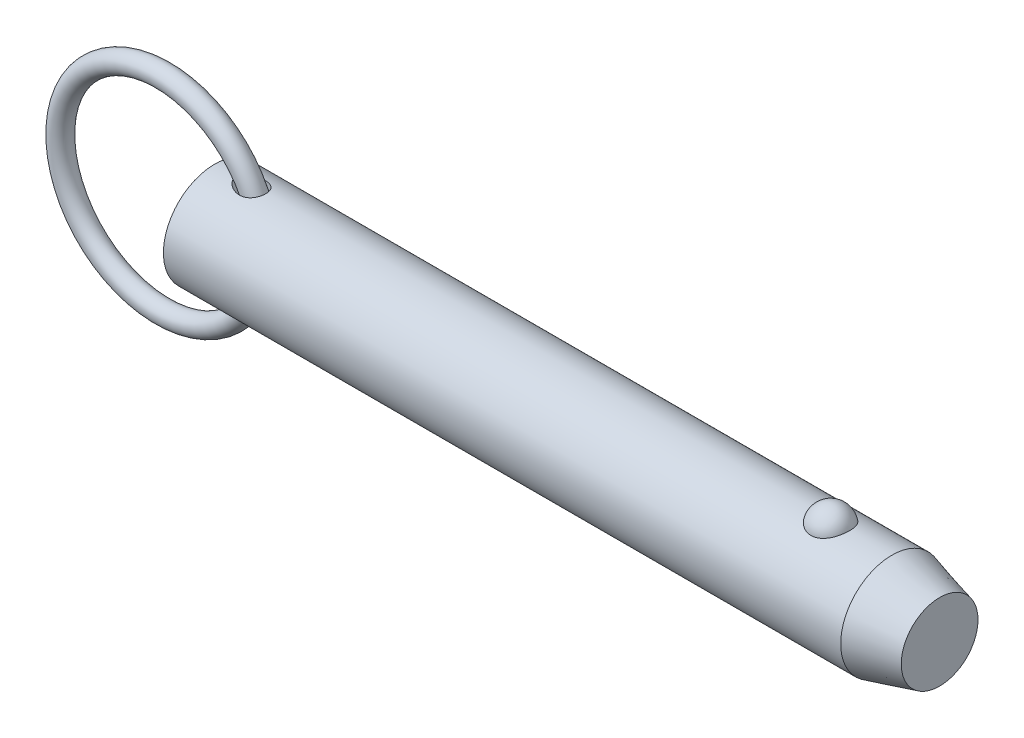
ISO-10303-21;
HEADER;
FILE_DESCRIPTION(('STEP AP214'),'2;1');
FILE_NAME('part.step','',(''),(''),'','','');
FILE_SCHEMA(('AUTOMOTIVE_DESIGN { 1 0 10303 214 1 1 1 1 }'));
ENDSEC;
DATA;
#1=APPLICATION_CONTEXT('core data for automotive mechanical design processes');
#2=APPLICATION_PROTOCOL_DEFINITION('international standard','automotive_design',2000,#1);
#3=PRODUCT_CONTEXT('',#1,'mechanical');
#4=PRODUCT('Part','Part','',(#3));
#5=PRODUCT_RELATED_PRODUCT_CATEGORY('part','',(#4));
#6=PRODUCT_DEFINITION_FORMATION('','',#4);
#7=PRODUCT_DEFINITION_CONTEXT('part definition',#1,'design');
#8=PRODUCT_DEFINITION('design','',#6,#7);
#9=PRODUCT_DEFINITION_SHAPE('','',#8);
#10=(LENGTH_UNIT() NAMED_UNIT(*) SI_UNIT(.MILLI.,.METRE.));
#11=(NAMED_UNIT(*) PLANE_ANGLE_UNIT() SI_UNIT($,.RADIAN.));
#12=(NAMED_UNIT(*) SI_UNIT($,.STERADIAN.) SOLID_ANGLE_UNIT());
#13=UNCERTAINTY_MEASURE_WITH_UNIT(LENGTH_MEASURE(1.E-05),#10,'distance_accuracy_value','');
#14=(GEOMETRIC_REPRESENTATION_CONTEXT(3) GLOBAL_UNCERTAINTY_ASSIGNED_CONTEXT((#13)) GLOBAL_UNIT_ASSIGNED_CONTEXT((#10,
#11,#12)) REPRESENTATION_CONTEXT('',''));
#15=CARTESIAN_POINT('',(0.,0.,0.));
#16=DIRECTION('',(0.,0.,1.));
#17=DIRECTION('',(1.,0.,0.));
#18=AXIS2_PLACEMENT_3D('',#15,#16,#17);
#19=CARTESIAN_POINT('',(-9.66825126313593,0.,0.));
#20=DIRECTION('',(0.,0.,1.));
#21=DIRECTION('',(1.,0.,0.));
#22=AXIS2_PLACEMENT_3D('',#19,#20,#21);
#23=TOROIDAL_SURFACE('',#22,19.05,1.905);
#24=CARTESIAN_POINT('',(11.2867487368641,0.,0.));
#25=VERTEX_POINT('',#24);
#26=VERTEX_LOOP('',#25);
#27=FACE_BOUND('',#26,.T.);
#28=ADVANCED_FACE('P0_F12',(#27),#23,.T.);
#29=CLOSED_SHELL('',(#28));
#30=MANIFOLD_SOLID_BREP('P0_B1',#29);
#31=CARTESIAN_POINT('',(0.,0.,0.));
#32=DIRECTION('',(1.,0.,0.));
#33=DIRECTION('',(0.,0.,-1.));
#34=AXIS2_PLACEMENT_3D('',#31,#32,#33);
#35=CYLINDRICAL_SURFACE('',#34,9.525);
#36=CARTESIAN_POINT('',(4.56693409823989,9.4314194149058,-1.33189820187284));
#37=CARTESIAN_POINT('',(4.70260475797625,9.41020313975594,-1.48215931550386));
#38=CARTESIAN_POINT('',(4.85555680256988,9.38755003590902,-1.61683982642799));
#39=CARTESIAN_POINT('',(5.10171959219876,9.35450554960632,-1.79512943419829));
#40=CARTESIAN_POINT('',(5.18674514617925,9.34362629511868,-1.85068909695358));
#41=CARTESIAN_POINT('',(5.3615438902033,9.32258514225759,-1.95392002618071));
#42=CARTESIAN_POINT('',(5.45131542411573,9.31242299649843,-2.00159402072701));
#43=CARTESIAN_POINT('',(5.70070211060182,9.28632120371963,-2.12033289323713));
#44=CARTESIAN_POINT('',(5.86420408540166,9.27146938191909,-2.18362944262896));
#45=CARTESIAN_POINT('',(6.19893345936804,9.24694163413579,-2.28525783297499));
#46=CARTESIAN_POINT('',(6.3701538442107,9.23726110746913,-2.32361187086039));
#47=CARTESIAN_POINT('',(6.73531776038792,9.22400982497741,-2.37575048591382));
#48=CARTESIAN_POINT('',(6.92975826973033,9.22118808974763,-2.38652934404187));
#49=CARTESIAN_POINT('',(7.21995443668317,9.22416297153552,-2.37494980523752));
#50=CARTESIAN_POINT('',(7.31643847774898,9.22635560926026,-2.366466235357));
#51=CARTESIAN_POINT('',(7.50796421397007,9.2331428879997,-2.33985028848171));
#52=CARTESIAN_POINT('',(7.60300650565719,9.23773650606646,-2.32172202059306));
#53=CARTESIAN_POINT('',(7.83273114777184,9.25183311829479,-2.26504721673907));
#54=CARTESIAN_POINT('',(7.96603028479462,9.26261470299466,-2.2209856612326));
#55=CARTESIAN_POINT('',(8.22310899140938,9.28816519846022,-2.1115730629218));
#56=CARTESIAN_POINT('',(8.34689477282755,9.30293147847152,-2.04623606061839));
#57=CARTESIAN_POINT('',(8.58136049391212,9.3349416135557,-1.89485344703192));
#58=CARTESIAN_POINT('',(8.69199721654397,9.35219324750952,-1.8087422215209));
#59=CARTESIAN_POINT('',(8.89592093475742,9.38707016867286,-1.6179918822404));
#60=CARTESIAN_POINT('',(8.98920771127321,9.40469546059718,-1.51335253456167));
#61=CARTESIAN_POINT('',(9.15057731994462,9.43713590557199,-1.29519427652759));
#62=CARTESIAN_POINT('',(9.21980158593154,9.45205440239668,-1.18253282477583));
#63=CARTESIAN_POINT('',(9.33826736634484,9.47856708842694,-0.946802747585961));
#64=CARTESIAN_POINT('',(9.38751161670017,9.49016173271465,-0.823735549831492));
#65=CARTESIAN_POINT('',(9.46423850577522,9.50859378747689,-0.572614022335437));
#66=CARTESIAN_POINT('',(9.4920239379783,9.5154972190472,-0.444656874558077));
#67=CARTESIAN_POINT('',(9.52636926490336,9.5240690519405,-0.185752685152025));
#68=CARTESIAN_POINT('',(9.53292923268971,9.52573747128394,-0.054805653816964));
#69=CARTESIAN_POINT('',(9.52467276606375,9.52365852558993,0.206503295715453));
#70=CARTESIAN_POINT('',(9.50983454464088,9.51990564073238,0.336864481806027));
#71=CARTESIAN_POINT('',(9.45907362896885,9.50737852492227,0.593166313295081));
#72=CARTESIAN_POINT('',(9.42315106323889,9.49860432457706,0.719106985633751));
#73=CARTESIAN_POINT('',(9.3310664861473,9.4769892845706,0.962959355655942));
#74=CARTESIAN_POINT('',(9.27490839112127,9.46414923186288,1.08087260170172));
#75=CARTESIAN_POINT('',(9.14375803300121,9.43581000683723,1.30534632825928));
#76=CARTESIAN_POINT('',(9.06876720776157,9.42031103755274,1.41190767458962));
#77=CARTESIAN_POINT('',(8.90203187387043,9.38836719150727,1.61069439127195));
#78=CARTESIAN_POINT('',(8.81029913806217,9.371922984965,1.70292975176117));
#79=CARTESIAN_POINT('',(8.6126877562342,9.33985045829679,1.87086859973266));
#80=CARTESIAN_POINT('',(8.50680947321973,9.3242221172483,1.94657251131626));
#81=CARTESIAN_POINT('',(8.28220546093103,9.29513431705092,2.08109032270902));
#82=CARTESIAN_POINT('',(8.16329919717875,9.28171415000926,2.13961034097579));
#83=CARTESIAN_POINT('',(7.91756052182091,9.25859072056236,2.23755716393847));
#84=CARTESIAN_POINT('',(7.79072606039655,9.24888842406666,2.27697900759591));
#85=CARTESIAN_POINT('',(7.52377913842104,9.23338749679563,2.33907806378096));
#86=CARTESIAN_POINT('',(7.3833476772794,9.22789571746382,2.36044900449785));
#87=CARTESIAN_POINT('',(7.1008139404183,9.22210229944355,2.3829751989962));
#88=CARTESIAN_POINT('',(6.95871103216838,9.22180269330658,2.38412253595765));
#89=CARTESIAN_POINT('',(6.65642691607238,9.22632724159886,2.36656230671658));
#90=CARTESIAN_POINT('',(6.49641694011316,9.23185415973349,2.3451317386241));
#91=CARTESIAN_POINT('',(6.18115433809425,9.24811737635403,2.28014143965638));
#92=CARTESIAN_POINT('',(6.02590710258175,9.25885936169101,2.23655754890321));
#93=CARTESIAN_POINT('',(5.69904720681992,9.28624254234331,2.12025087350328));
#94=CARTESIAN_POINT('',(5.52873601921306,9.30354853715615,2.04400672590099));
#95=CARTESIAN_POINT('',(5.20289495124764,9.34106989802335,1.86504730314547));
#96=CARTESIAN_POINT('',(5.0473596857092,9.36128419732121,1.76234172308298));
#97=CARTESIAN_POINT('',(4.7928712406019,9.39697639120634,1.55895334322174));
#98=CARTESIAN_POINT('',(4.68938704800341,9.41240250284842,1.46392900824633));
#99=CARTESIAN_POINT('',(4.4984714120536,9.44202586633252,1.25875918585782));
#100=CARTESIAN_POINT('',(4.41101129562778,9.45622528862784,1.1486413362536));
#101=CARTESIAN_POINT('',(4.27502257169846,9.47888210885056,0.94060098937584));
#102=CARTESIAN_POINT('',(4.22216329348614,9.48791121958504,0.845586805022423));
#103=CARTESIAN_POINT('',(4.13241478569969,9.50344321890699,0.648051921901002));
#104=CARTESIAN_POINT('',(4.0955118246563,9.50994827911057,0.545537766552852));
#105=CARTESIAN_POINT('',(4.04043124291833,9.51971586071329,0.334452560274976));
#106=CARTESIAN_POINT('',(4.02240728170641,9.52295176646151,0.225839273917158));
#107=CARTESIAN_POINT('',(4.00750873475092,9.52562364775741,0.00713006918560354));
#108=CARTESIAN_POINT('',(4.01062334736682,9.52506156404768,-0.102965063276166));
#109=CARTESIAN_POINT('',(4.03592967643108,9.52053221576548,-0.306944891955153));
#110=CARTESIAN_POINT('',(4.05571676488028,9.51699426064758,-0.401151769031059));
#111=CARTESIAN_POINT('',(4.10967975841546,9.5074546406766,-0.585176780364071));
#112=CARTESIAN_POINT('',(4.1438599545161,9.50145224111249,-0.674993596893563));
#113=CARTESIAN_POINT('',(4.23261356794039,9.48611703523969,-0.866116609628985));
#114=CARTESIAN_POINT('',(4.28990016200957,9.47635800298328,-0.966121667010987));
#115=CARTESIAN_POINT('',(4.4185657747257,9.45502867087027,-1.15640011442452));
#116=CARTESIAN_POINT('',(4.4899691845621,9.44345524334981,-1.24665623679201));
#117=CARTESIAN_POINT('',(4.56693409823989,9.4314194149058,-1.33189820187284));
#118=B_SPLINE_CURVE_WITH_KNOTS('',3,(#36,#37,#38,#39,#40,#41,#42,#43,#44,#45,#46,#47,#48,#49,
#50,#51,#52,#53,#54,#55,#56,#57,#58,#59,#60,#61,#62,#63,#64,#65,#66,#67,#68,#69,#70,#71,#72,#73,
#74,#75,#76,#77,#78,#79,#80,#81,#82,#83,#84,#85,#86,#87,#88,#89,#90,#91,#92,#93,#94,#95,#96,#97,
#98,#99,#100,#101,#102,#103,#104,#105,#106,#107,#108,#109,#110,#111,#112,#113,#114,#115,#116,
#117),.UNSPECIFIED.,.T.,.F.,(4,2,2,2,2,2,2,2,2,2,2,2,2,2,2,2,2,2,2,2,2,2,2,2,2,2,2,2,2,2,2,2,2,
2,2,2,2,2,2,2,4),(0.,0.609951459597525,0.916123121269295,1.22218863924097,1.74791337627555,
2.27316961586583,2.85362722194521,3.14383229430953,3.43391382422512,3.85437497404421,
4.27455920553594,4.69608835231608,5.11762282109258,5.51490051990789,5.91212379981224,
6.30363414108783,6.69514313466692,7.0870510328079,7.47895654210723,7.87078624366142,
8.26258603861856,8.65411137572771,9.0456266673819,9.44349251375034,9.84146165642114,
10.2662286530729,10.6911619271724,11.1739180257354,11.6572017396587,12.2170157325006,
12.776624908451,13.1992556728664,13.6211226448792,13.9471990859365,14.2729943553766,
14.6014211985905,14.9296802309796,15.2173810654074,15.505167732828,15.8505863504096,
16.1966070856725),.UNSPECIFIED.);
#119=CARTESIAN_POINT('',(4.56693409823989,9.4314194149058,-1.33189820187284));
#120=VERTEX_POINT('',#119);
#121=EDGE_CURVE('P1_E40',#120,#120,#118,.T.);
#122=ORIENTED_EDGE('',*,*,#121,.T.);
#123=EDGE_LOOP('',(#122));
#124=FACE_BOUND('',#123,.T.);
#125=CARTESIAN_POINT('',(126.043054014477,0.,0.));
#126=DIRECTION('',(1.,0.,0.));
#127=DIRECTION('',(0.,0.,-1.));
#128=AXIS2_PLACEMENT_3D('',#125,#126,#127);
#129=CIRCLE('',#128,9.525);
#130=CARTESIAN_POINT('',(126.043054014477,0.,-9.525));
#131=VERTEX_POINT('',#130);
#132=EDGE_CURVE('P1_E25',#131,#131,#129,.T.);
#133=ORIENTED_EDGE('',*,*,#132,.F.);
#134=EDGE_LOOP('',(#133));
#135=FACE_BOUND('',#134,.T.);
#136=CARTESIAN_POINT('',(0.,0.,0.));
#137=DIRECTION('',(1.,0.,0.));
#138=DIRECTION('',(0.,0.,-1.));
#139=AXIS2_PLACEMENT_3D('',#136,#137,#138);
#140=CIRCLE('',#139,9.525);
#141=CARTESIAN_POINT('',(0.,0.,-9.525));
#142=VERTEX_POINT('',#141);
#143=EDGE_CURVE('P1_E9',#142,#142,#140,.T.);
#144=ORIENTED_EDGE('',*,*,#143,.T.);
#145=EDGE_LOOP('',(#144));
#146=FACE_BOUND('',#145,.T.);
#147=CARTESIAN_POINT('',(114.645757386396,8.80405803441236,3.63513233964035));
#148=CARTESIAN_POINT('',(114.551676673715,8.80405953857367,3.63513053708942));
#149=CARTESIAN_POINT('',(114.457561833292,8.80561325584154,3.6313746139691));
#150=CARTESIAN_POINT('',(114.270012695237,8.81177748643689,3.61638665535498));
#151=CARTESIAN_POINT('',(114.176578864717,8.81638992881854,3.60514990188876));
#152=CARTESIAN_POINT('',(113.897945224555,8.8346711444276,3.56024627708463));
#153=CARTESIAN_POINT('',(113.714691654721,8.85278327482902,3.51538626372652));
#154=CARTESIAN_POINT('',(113.359509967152,8.89871214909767,3.39742145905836));
#155=CARTESIAN_POINT('',(113.187553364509,8.92650327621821,3.32439116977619));
#156=CARTESIAN_POINT('',(112.858707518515,8.98874819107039,3.15220244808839));
#157=CARTESIAN_POINT('',(112.701811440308,9.02319893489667,3.05305594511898));
#158=CARTESIAN_POINT('',(112.402214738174,9.09629186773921,2.82797815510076));
#159=CARTESIAN_POINT('',(112.260060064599,9.13502685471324,2.7013513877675));
#160=CARTESIAN_POINT('',(111.998299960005,9.2118657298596,2.4264193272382));
#161=CARTESIAN_POINT('',(111.878701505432,9.2499694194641,2.27810735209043));
#162=CARTESIAN_POINT('',(111.659645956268,9.32341082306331,1.95652290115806));
#163=CARTESIAN_POINT('',(111.561317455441,9.35855090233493,1.78243511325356));
#164=CARTESIAN_POINT('',(111.393819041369,9.42045142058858,1.41937246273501));
#165=CARTESIAN_POINT('',(111.324651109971,9.44721128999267,1.23039658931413));
#166=CARTESIAN_POINT('',(111.216199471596,9.48990641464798,0.840370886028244));
#167=CARTESIAN_POINT('',(111.177288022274,9.50570658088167,0.639202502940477));
#168=CARTESIAN_POINT('',(111.131555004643,9.52433146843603,0.232664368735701));
#169=CARTESIAN_POINT('',(111.124732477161,9.52715657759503,0.0272947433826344));
#170=CARTESIAN_POINT('',(111.143255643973,9.51956918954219,-0.38047887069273));
#171=CARTESIAN_POINT('',(111.168405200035,9.50923740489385,-0.582893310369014));
#172=CARTESIAN_POINT('',(111.25002537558,9.47651897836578,-0.980293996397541));
#173=CARTESIAN_POINT('',(111.306496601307,9.45413210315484,-1.17528009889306));
#174=CARTESIAN_POINT('',(111.449719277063,9.39954044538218,-1.55263697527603));
#175=CARTESIAN_POINT('',(111.536512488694,9.36732213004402,-1.73498993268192));
#176=CARTESIAN_POINT('',(111.738610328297,9.29640700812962,-2.08177763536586));
#177=CARTESIAN_POINT('',(111.853917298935,9.25770966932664,-2.24621090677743));
#178=CARTESIAN_POINT('',(112.111264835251,9.17775604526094,-2.5533833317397));
#179=CARTESIAN_POINT('',(112.253434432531,9.136488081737,-2.696011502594));
#180=CARTESIAN_POINT('',(112.56089985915,9.05620497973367,-2.95451229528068));
#181=CARTESIAN_POINT('',(112.726193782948,9.01718965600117,-3.07038711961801));
#182=CARTESIAN_POINT('',(113.072052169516,8.94680019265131,-3.26976836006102));
#183=CARTESIAN_POINT('',(113.252227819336,8.91528408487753,-3.35389750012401));
#184=CARTESIAN_POINT('',(113.625651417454,8.86272514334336,-3.49043503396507));
#185=CARTESIAN_POINT('',(113.818894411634,8.84167836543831,-3.54285537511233));
#186=CARTESIAN_POINT('',(114.202503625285,8.81348056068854,-3.61241306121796));
#187=CARTESIAN_POINT('',(114.392525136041,8.80568348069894,-3.63119339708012));
#188=CARTESIAN_POINT('',(114.773190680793,8.80289410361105,-3.63795342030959));
#189=CARTESIAN_POINT('',(114.963834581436,8.80789922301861,-3.62593932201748));
#190=CARTESIAN_POINT('',(115.334007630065,8.82974915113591,-3.57238430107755));
#191=CARTESIAN_POINT('',(115.513697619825,8.84621463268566,-3.53178890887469));
#192=CARTESIAN_POINT('',(115.863422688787,8.88875330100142,-3.42331083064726));
#193=CARTESIAN_POINT('',(116.033456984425,8.91482726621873,-3.35542593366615));
#194=CARTESIAN_POINT('',(116.363237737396,8.97448239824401,-3.19248225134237));
#195=CARTESIAN_POINT('',(116.522680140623,9.00821446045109,-3.09686474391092));
#196=CARTESIAN_POINT('',(116.823513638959,9.07935398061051,-2.88162736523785));
#197=CARTESIAN_POINT('',(116.964900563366,9.11676228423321,-2.76200196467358));
#198=CARTESIAN_POINT('',(117.23331931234,9.19347419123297,-2.49516285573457));
#199=CARTESIAN_POINT('',(117.359275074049,9.23277872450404,-2.34686614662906));
#200=CARTESIAN_POINT('',(117.585522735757,9.30737610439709,-2.03093683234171));
#201=CARTESIAN_POINT('',(117.68581004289,9.34266823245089,-1.86330077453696));
#202=CARTESIAN_POINT('',(117.861514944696,9.40674710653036,-1.50744893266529));
#203=CARTESIAN_POINT('',(117.936041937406,9.43529176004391,-1.31874876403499));
#204=CARTESIAN_POINT('',(118.05416505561,9.48144132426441,-0.930631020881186));
#205=CARTESIAN_POINT('',(118.097760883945,9.49904612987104,-0.731213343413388));
#206=CARTESIAN_POINT('',(118.153158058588,9.5215314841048,-0.327147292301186));
#207=CARTESIAN_POINT('',(118.164935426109,9.52640243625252,-0.122495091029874));
#208=CARTESIAN_POINT('',(118.156382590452,9.5228957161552,0.286018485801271));
#209=CARTESIAN_POINT('',(118.13605305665,9.5145183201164,0.48987987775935));
#210=CARTESIAN_POINT('',(118.063884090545,9.48544083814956,0.889994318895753));
#211=CARTESIAN_POINT('',(118.012199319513,9.46480124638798,1.08627971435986));
#212=CARTESIAN_POINT('',(117.878491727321,9.4133389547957,1.46682086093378));
#213=CARTESIAN_POINT('',(117.796466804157,9.38251554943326,1.65107577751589));
#214=CARTESIAN_POINT('',(117.60319292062,9.31365636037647,2.00346348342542));
#215=CARTESIAN_POINT('',(117.491783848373,9.27558138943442,2.17150083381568));
#216=CARTESIAN_POINT('',(117.242294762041,9.19638714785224,2.48563115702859));
#217=CARTESIAN_POINT('',(117.104216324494,9.15526805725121,2.63172542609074));
#218=CARTESIAN_POINT('',(116.804843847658,9.07465393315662,2.89750997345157));
#219=CARTESIAN_POINT('',(116.643610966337,9.03515496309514,3.01726776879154));
#220=CARTESIAN_POINT('',(116.301613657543,8.96227564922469,3.22732920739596));
#221=CARTESIAN_POINT('',(116.120841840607,8.92889763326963,3.31762165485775));
#222=CARTESIAN_POINT('',(115.751445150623,8.8734538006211,3.46314419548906));
#223=CARTESIAN_POINT('',(115.56332371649,8.85102983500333,3.51950082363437));
#224=CARTESIAN_POINT('',(115.27578699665,8.8266696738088,3.57993683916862));
#225=CARTESIAN_POINT('',(115.179133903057,8.82009725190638,3.59606217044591));
#226=CARTESIAN_POINT('',(114.984677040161,8.81020897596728,3.62022512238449));
#227=CARTESIAN_POINT('',(114.88687410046,8.80689090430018,3.62826825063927));
#228=CARTESIAN_POINT('',(114.741224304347,8.80445615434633,3.63416760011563));
#229=CARTESIAN_POINT('',(114.693495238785,8.80405727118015,3.63513325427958));
#230=CARTESIAN_POINT('',(114.645757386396,8.80405803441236,3.63513233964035));
#231=B_SPLINE_CURVE_WITH_KNOTS('',3,(#147,#148,#149,#150,#151,#152,#153,#154,#155,#156,#157,
#158,#159,#160,#161,#162,#163,#164,#165,#166,#167,#168,#169,#170,#171,#172,#173,#174,#175,#176,
#177,#178,#179,#180,#181,#182,#183,#184,#185,#186,#187,#188,#189,#190,#191,#192,#193,#194,#195,
#196,#197,#198,#199,#200,#201,#202,#203,#204,#205,#206,#207,#208,#209,#210,#211,#212,#213,#214,
#215,#216,#217,#218,#219,#220,#221,#222,#223,#224,#225,#226,#227,#228,#229,#230),.UNSPECIFIED.,
.T.,.F.,(4,2,2,2,2,2,2,2,2,2,2,2,2,2,2,2,2,2,2,2,2,2,2,2,2,2,2,2,2,2,2,2,2,2,2,2,2,2,2,2,2,4),
(0.,0.282202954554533,0.564584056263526,1.13017050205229,1.69427128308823,2.258114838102,
2.83836627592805,3.41879688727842,4.02497117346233,4.63118665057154,5.24474754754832,
5.85829010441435,6.46808687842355,7.0778954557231,7.68854723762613,8.29924920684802,
8.91296283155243,9.52662591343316,10.1275338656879,10.7282152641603,11.2986646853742,
11.868998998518,12.4213015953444,12.973648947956,13.5380053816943,14.1024919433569,
14.695298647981,15.2882113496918,15.8999469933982,16.5116885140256,17.1238909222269,
17.7360805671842,18.3452748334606,18.9545113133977,19.567138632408,20.1797297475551,
20.7907316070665,21.4019653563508,21.9915938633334,22.2859053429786,22.580016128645,
22.723209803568),.UNSPECIFIED.);
#232=CARTESIAN_POINT('',(114.645757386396,8.80405803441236,3.63513233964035));
#233=VERTEX_POINT('',#232);
#234=EDGE_CURVE('P1_E34',#233,#233,#231,.T.);
#235=ORIENTED_EDGE('',*,*,#234,.T.);
#236=EDGE_LOOP('',(#235));
#237=FACE_BOUND('',#236,.T.);
#238=CARTESIAN_POINT('',(4.56693409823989,-9.4314194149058,-1.33189820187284));
#239=CARTESIAN_POINT('',(4.48932984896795,-9.4435553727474,-1.24594548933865));
#240=CARTESIAN_POINT('',(4.41737309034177,-9.45522193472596,-1.1548795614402));
#241=CARTESIAN_POINT('',(4.2878104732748,-9.47670896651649,-0.962782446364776));
#242=CARTESIAN_POINT('',(4.23019403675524,-9.48653079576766,-0.861758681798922));
#243=CARTESIAN_POINT('',(4.132545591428,-9.5034118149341,-0.649723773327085));
#244=CARTESIAN_POINT('',(4.09271158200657,-9.51043980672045,-0.538615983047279));
#245=CARTESIAN_POINT('',(4.04973167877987,-9.51806966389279,-0.367764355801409));
#246=CARTESIAN_POINT('',(4.03820037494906,-9.52012756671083,-0.310118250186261));
#247=CARTESIAN_POINT('',(4.02100287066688,-9.52320274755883,-0.193935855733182));
#248=CARTESIAN_POINT('',(4.01533565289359,-9.52422020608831,-0.135399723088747));
#249=CARTESIAN_POINT('',(4.0081707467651,-9.52550497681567,0.0247266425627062));
#250=CARTESIAN_POINT('',(4.01270492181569,-9.52468821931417,0.126661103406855));
#251=CARTESIAN_POINT('',(4.03954973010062,-9.51988506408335,0.328012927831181));
#252=CARTESIAN_POINT('',(4.06186450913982,-9.51589792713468,0.427429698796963));
#253=CARTESIAN_POINT('',(4.12088980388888,-9.50548528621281,0.616362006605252));
#254=CARTESIAN_POINT('',(4.15684838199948,-9.49918763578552,0.706123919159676));
#255=CARTESIAN_POINT('',(4.24094647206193,-9.48470618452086,0.879522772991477));
#256=CARTESIAN_POINT('',(4.28909090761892,-9.47652162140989,0.963157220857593));
#257=CARTESIAN_POINT('',(4.42295891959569,-9.45426317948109,1.16513741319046));
#258=CARTESIAN_POINT('',(4.51523752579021,-9.43933320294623,1.27905352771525));
#259=CARTESIAN_POINT('',(4.71682295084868,-9.40825940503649,1.49055892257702));
#260=CARTESIAN_POINT('',(4.82617286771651,-9.39211256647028,1.58810554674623));
#261=CARTESIAN_POINT('',(5.09064226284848,-9.35555264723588,1.79246125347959));
#262=CARTESIAN_POINT('',(5.2499041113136,-9.33524115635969,1.89393122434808));
#263=CARTESIAN_POINT('',(5.58309255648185,-9.29785396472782,2.06968659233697));
#264=CARTESIAN_POINT('',(5.75702897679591,-9.28078045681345,2.14395359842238));
#265=CARTESIAN_POINT('',(6.11646882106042,-9.25213303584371,2.26440412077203));
#266=CARTESIAN_POINT('',(6.30205582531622,-9.2406056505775,2.31035092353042));
#267=CARTESIAN_POINT('',(6.67856093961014,-9.22541807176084,2.37029728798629));
#268=CARTESIAN_POINT('',(6.8694704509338,-9.2217458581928,2.3843456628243));
#269=CARTESIAN_POINT('',(7.21217144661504,-9.2234423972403,2.37775005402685));
#270=CARTESIAN_POINT('',(7.36409439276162,-9.22713860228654,2.36352577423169));
#271=CARTESIAN_POINT('',(7.66346227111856,-9.24048072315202,2.31082299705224));
#272=CARTESIAN_POINT('',(7.81090958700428,-9.25012341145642,2.27235765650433));
#273=CARTESIAN_POINT('',(8.09730316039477,-9.2746609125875,2.17003648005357));
#274=CARTESIAN_POINT('',(8.23619652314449,-9.28958517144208,2.10603803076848));
#275=CARTESIAN_POINT('',(8.49918675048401,-9.32290326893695,1.95324442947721));
#276=CARTESIAN_POINT('',(8.62328895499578,-9.34129584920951,1.86445826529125));
#277=CARTESIAN_POINT('',(8.84006515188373,-9.37706953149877,1.67466761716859));
#278=CARTESIAN_POINT('',(8.93465172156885,-9.39436331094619,1.57582357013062));
#279=CARTESIAN_POINT('',(9.1049023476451,-9.42761680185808,1.362809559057));
#280=CARTESIAN_POINT('',(9.18057146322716,-9.44357686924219,1.24864370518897));
#281=CARTESIAN_POINT('',(9.30789178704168,-9.47159985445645,1.01379272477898));
#282=CARTESIAN_POINT('',(9.36045544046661,-9.48380365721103,0.893617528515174));
#283=CARTESIAN_POINT('',(9.44498362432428,-9.50388751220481,0.645890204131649));
#284=CARTESIAN_POINT('',(9.47694947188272,-9.51176784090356,0.518338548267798));
#285=CARTESIAN_POINT('',(9.51944262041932,-9.52232073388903,0.260103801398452));
#286=CARTESIAN_POINT('',(9.53006646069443,-9.52501674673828,0.129437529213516));
#287=CARTESIAN_POINT('',(9.52993291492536,-9.52498309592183,-0.131885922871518));
#288=CARTESIAN_POINT('',(9.5191752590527,-9.52225336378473,-0.262543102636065));
#289=CARTESIAN_POINT('',(9.47648788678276,-9.51165418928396,-0.520312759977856));
#290=CARTESIAN_POINT('',(9.44453086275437,-9.50377811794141,-0.647420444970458));
#291=CARTESIAN_POINT('',(9.36015568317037,-9.48373425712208,-0.894290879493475));
#292=CARTESIAN_POINT('',(9.30773827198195,-9.47156662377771,-1.01405389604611));
#293=CARTESIAN_POINT('',(9.1838089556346,-9.44428888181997,-1.24269386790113));
#294=CARTESIAN_POINT('',(9.11232064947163,-9.42918241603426,-1.35158405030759));
#295=CARTESIAN_POINT('',(8.9521268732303,-9.39767706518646,-1.55562459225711));
#296=CARTESIAN_POINT('',(8.86342281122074,-9.3812782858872,-1.65077607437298));
#297=CARTESIAN_POINT('',(8.67104443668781,-9.34891827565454,-1.8251751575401));
#298=CARTESIAN_POINT('',(8.56732858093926,-9.33295841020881,-1.90437711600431));
#299=CARTESIAN_POINT('',(8.34818438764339,-9.30317889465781,-2.0449122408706));
#300=CARTESIAN_POINT('',(8.23275529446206,-9.28935938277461,-2.10624425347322));
#301=CARTESIAN_POINT('',(7.98961240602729,-9.26475003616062,-2.2120340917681));
#302=CARTESIAN_POINT('',(7.86162088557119,-9.25407358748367,-2.25587700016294));
#303=CARTESIAN_POINT('',(7.60027499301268,-9.23720810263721,-2.32397032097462));
#304=CARTESIAN_POINT('',(7.46691858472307,-9.23102078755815,-2.34821321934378));
#305=CARTESIAN_POINT('',(7.18516230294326,-9.22302718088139,-2.37943079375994));
#306=CARTESIAN_POINT('',(7.03654454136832,-9.22169704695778,-2.38452997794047));
#307=CARTESIAN_POINT('',(6.7401504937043,-9.22442327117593,-2.37395141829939));
#308=CARTESIAN_POINT('',(6.59237455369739,-9.22848170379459,-2.35826567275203));
#309=CARTESIAN_POINT('',(6.27762777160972,-9.2422287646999,-2.30385559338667));
#310=CARTESIAN_POINT('',(6.11124715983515,-9.25269504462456,-2.26192683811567));
#311=CARTESIAN_POINT('',(5.78635920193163,-9.27830776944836,-2.15445569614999));
#312=CARTESIAN_POINT('',(5.62786567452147,-9.29346211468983,-2.08887341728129));
#313=CARTESIAN_POINT('',(5.39013065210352,-9.31931237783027,-1.96924953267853));
#314=CARTESIAN_POINT('',(5.30683088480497,-9.32901725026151,-1.92292485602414));
#315=CARTESIAN_POINT('',(5.1445580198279,-9.34899035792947,-1.82334419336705));
#316=CARTESIAN_POINT('',(5.06558607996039,-9.35925874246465,-1.77008636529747));
#317=CARTESIAN_POINT('',(4.83670950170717,-9.39034445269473,-1.60010986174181));
#318=CARTESIAN_POINT('',(4.69422471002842,-9.41151337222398,-1.47288240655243));
#319=CARTESIAN_POINT('',(4.56693409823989,-9.4314194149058,-1.33189820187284));
#320=B_SPLINE_CURVE_WITH_KNOTS('',3,(#238,#239,#240,#241,#242,#243,#244,#245,#246,#247,#248,
#249,#250,#251,#252,#253,#254,#255,#256,#257,#258,#259,#260,#261,#262,#263,#264,#265,#266,#267,
#268,#269,#270,#271,#272,#273,#274,#275,#276,#277,#278,#279,#280,#281,#282,#283,#284,#285,#286,
#287,#288,#289,#290,#291,#292,#293,#294,#295,#296,#297,#298,#299,#300,#301,#302,#303,#304,#305,
#306,#307,#308,#309,#310,#311,#312,#313,#314,#315,#316,#317,#318,#319),.UNSPECIFIED.,.T.,.F.,(4,
2,2,2,2,2,2,2,2,2,2,2,2,2,2,2,2,2,2,2,2,2,2,2,2,2,2,2,2,2,2,2,2,2,2,2,2,2,2,2,4),(0.,
0.348900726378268,0.697543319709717,1.0499765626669,1.22617690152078,1.40234666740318,
1.70666745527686,2.01105922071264,2.30066493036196,2.59038784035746,3.03001384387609,
3.4707682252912,4.03766594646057,4.60494622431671,5.17690598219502,5.74798989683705,
6.20400848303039,6.65977977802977,7.11813321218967,7.57632066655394,7.98791759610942,
8.39940433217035,8.79273459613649,9.18603970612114,9.57756168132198,9.96908859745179,
10.3611208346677,10.7531388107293,11.1446739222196,11.536177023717,11.9287850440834,
12.3214184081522,12.7268448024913,13.1324265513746,13.5768390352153,14.0214226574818,
14.5351685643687,15.0497849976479,15.3368801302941,15.6240516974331,16.1963372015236),.UNSPECIFIED.);
#321=CARTESIAN_POINT('',(4.56693409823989,-9.4314194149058,-1.33189820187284));
#322=VERTEX_POINT('',#321);
#323=EDGE_CURVE('P1_E17',#322,#322,#320,.T.);
#324=ORIENTED_EDGE('',*,*,#323,.T.);
#325=EDGE_LOOP('',(#324));
#326=FACE_BOUND('',#325,.T.);
#327=ADVANCED_FACE('P1_F13',(#124,#135,#146,#237,#326),#35,.T.);
#328=CARTESIAN_POINT('',(0.,0.,0.));
#329=DIRECTION('',(-1.,0.,0.));
#330=DIRECTION('',(0.,0.,1.));
#331=AXIS2_PLACEMENT_3D('',#328,#329,#330);
#332=PLANE('',#331);
#333=ORIENTED_EDGE('',*,*,#143,.F.);
#334=EDGE_LOOP('',(#333));
#335=FACE_BOUND('',#334,.T.);
#336=ADVANCED_FACE('P1_F15',(#335),#332,.T.);
#337=CARTESIAN_POINT('',(134.93,0.,0.));
#338=DIRECTION('',(-1.,0.,0.));
#339=DIRECTION('',(0.,0.,1.));
#340=AXIS2_PLACEMENT_3D('',#337,#338,#339);
#341=CONICAL_SURFACE('',#340,7.14375000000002,0.26179938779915);
#342=ORIENTED_EDGE('',*,*,#132,.T.);
#343=EDGE_LOOP('',(#342));
#344=FACE_BOUND('',#343,.T.);
#345=CARTESIAN_POINT('',(134.93,0.,0.));
#346=DIRECTION('',(1.,0.,0.));
#347=DIRECTION('',(0.,0.,-1.));
#348=AXIS2_PLACEMENT_3D('',#345,#346,#347);
#349=CIRCLE('',#348,7.14375000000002);
#350=CARTESIAN_POINT('',(134.93,0.,-7.14375000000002));
#351=VERTEX_POINT('',#350);
#352=EDGE_CURVE('P1_E30',#351,#351,#349,.T.);
#353=ORIENTED_EDGE('',*,*,#352,.F.);
#354=EDGE_LOOP('',(#353));
#355=FACE_BOUND('',#354,.T.);
#356=ADVANCED_FACE('P1_F55',(#344,#355),#341,.T.);
#357=CARTESIAN_POINT('',(134.93,7.14375000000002,0.));
#358=DIRECTION('',(1.,0.,0.));
#359=DIRECTION('',(0.,0.,-1.));
#360=AXIS2_PLACEMENT_3D('',#357,#358,#359);
#361=PLANE('',#360);
#362=ORIENTED_EDGE('',*,*,#352,.T.);
#363=EDGE_LOOP('',(#362));
#364=FACE_BOUND('',#363,.T.);
#365=ADVANCED_FACE('P1_F51',(#364),#361,.T.);
#366=CARTESIAN_POINT('',(114.645757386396,8.5725,0.));
#367=DIRECTION('',(-1.,0.,0.));
#368=DIRECTION('',(0.,1.,0.));
#369=AXIS2_PLACEMENT_3D('',#366,#367,#368);
#370=SPHERICAL_SURFACE('',#369,3.64250000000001);
#371=ORIENTED_EDGE('',*,*,#234,.F.);
#372=EDGE_LOOP('',(#371));
#373=FACE_BOUND('',#372,.T.);
#374=ADVANCED_FACE('P1_F46',(#373),#370,.T.);
#375=CARTESIAN_POINT('',(-9.66825126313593,0.,0.));
#376=DIRECTION('',(0.,0.,1.));
#377=DIRECTION('',(1.,0.,0.));
#378=AXIS2_PLACEMENT_3D('',#375,#376,#377);
#379=TOROIDAL_SURFACE('',#378,19.05,2.38125);
#380=ORIENTED_EDGE('',*,*,#323,.F.);
#381=EDGE_LOOP('',(#380));
#382=FACE_BOUND('',#381,.T.);
#383=ORIENTED_EDGE('',*,*,#121,.F.);
#384=EDGE_LOOP('',(#383));
#385=FACE_BOUND('',#384,.T.);
#386=ADVANCED_FACE('P1_F50',(#382,#385),#379,.F.);
#387=CLOSED_SHELL('',(#327,#336,#356,#365,#374,#386));
#388=MANIFOLD_SOLID_BREP('P1_B1',#387);
#389=ADVANCED_BREP_SHAPE_REPRESENTATION('',(#18,#30,#388),#14);
#390=SHAPE_DEFINITION_REPRESENTATION(#9,#389);
ENDSEC;
END-ISO-10303-21;
